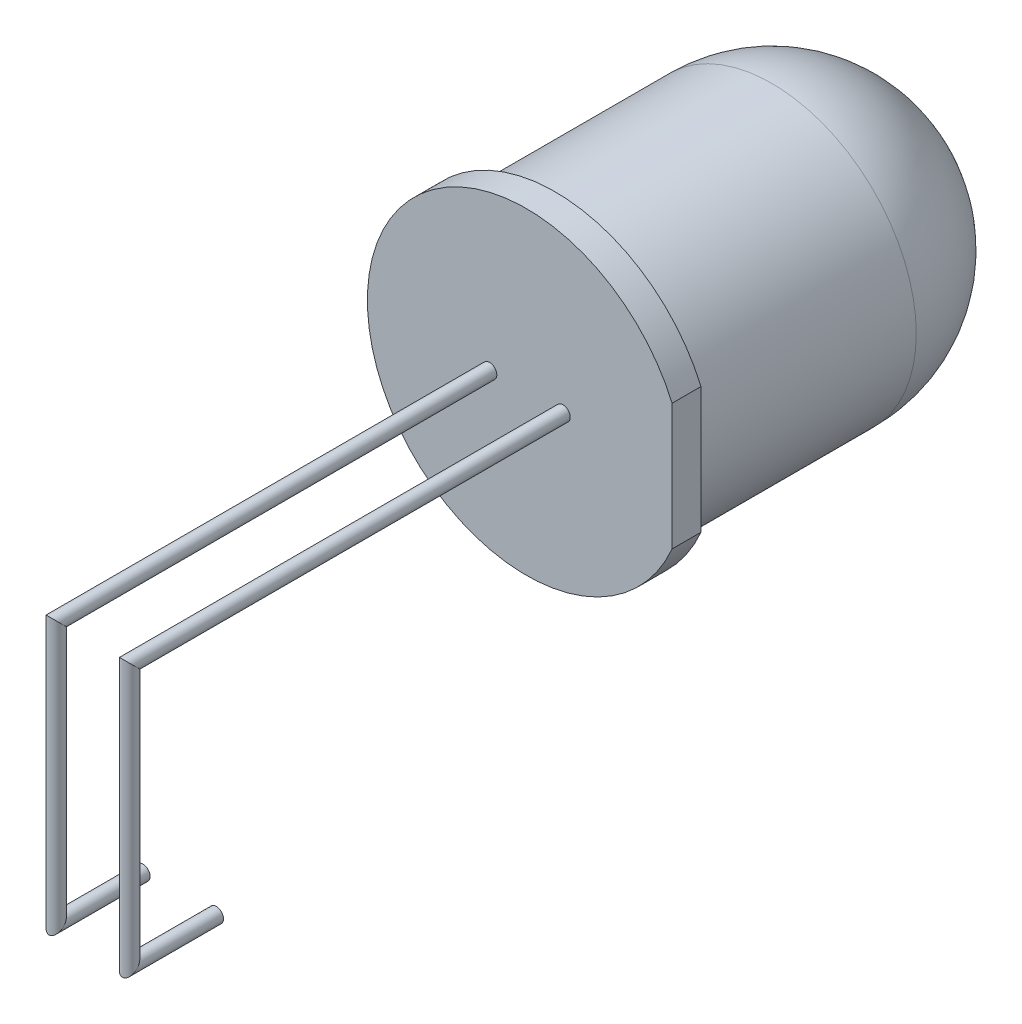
ISO-10303-21;
HEADER;
FILE_DESCRIPTION(('STEP AP214'),'2;1');
FILE_NAME('part.step','',(''),(''),'','','');
FILE_SCHEMA(('AUTOMOTIVE_DESIGN { 1 0 10303 214 1 1 1 1 }'));
ENDSEC;
DATA;
#1=APPLICATION_CONTEXT('core data for automotive mechanical design processes');
#2=APPLICATION_PROTOCOL_DEFINITION('international standard','automotive_design',2000,#1);
#3=PRODUCT_CONTEXT('',#1,'mechanical');
#4=PRODUCT('Part','Part','',(#3));
#5=PRODUCT_RELATED_PRODUCT_CATEGORY('part','',(#4));
#6=PRODUCT_DEFINITION_FORMATION('','',#4);
#7=PRODUCT_DEFINITION_CONTEXT('part definition',#1,'design');
#8=PRODUCT_DEFINITION('design','',#6,#7);
#9=PRODUCT_DEFINITION_SHAPE('','',#8);
#10=(LENGTH_UNIT() NAMED_UNIT(*) SI_UNIT(.MILLI.,.METRE.));
#11=(NAMED_UNIT(*) PLANE_ANGLE_UNIT() SI_UNIT($,.RADIAN.));
#12=(NAMED_UNIT(*) SI_UNIT($,.STERADIAN.) SOLID_ANGLE_UNIT());
#13=UNCERTAINTY_MEASURE_WITH_UNIT(LENGTH_MEASURE(1.E-05),#10,'distance_accuracy_value','');
#14=(GEOMETRIC_REPRESENTATION_CONTEXT(3) GLOBAL_UNCERTAINTY_ASSIGNED_CONTEXT((#13)) GLOBAL_UNIT_ASSIGNED_CONTEXT((#10,
#11,#12)) REPRESENTATION_CONTEXT('',''));
#15=CARTESIAN_POINT('',(0.,0.,0.));
#16=DIRECTION('',(0.,0.,1.));
#17=DIRECTION('',(1.,0.,0.));
#18=AXIS2_PLACEMENT_3D('',#15,#16,#17);
#19=CARTESIAN_POINT('',(0.,0.,13.5));
#20=DIRECTION('',(0.,0.,1.));
#21=DIRECTION('',(1.,0.,0.));
#22=AXIS2_PLACEMENT_3D('',#19,#20,#21);
#23=PLANE('',#22);
#24=CARTESIAN_POINT('',(1.27,0.,13.5));
#25=DIRECTION('',(0.,0.,1.));
#26=DIRECTION('',(1.,0.,0.));
#27=AXIS2_PLACEMENT_3D('',#24,#25,#26);
#28=CIRCLE('',#27,0.25);
#29=CARTESIAN_POINT('',(1.52,0.,13.5));
#30=VERTEX_POINT('',#29);
#31=EDGE_CURVE('E11',#30,#30,#28,.T.);
#32=ORIENTED_EDGE('',*,*,#31,.F.);
#33=EDGE_LOOP('',(#32));
#34=FACE_BOUND('',#33,.T.);
#35=CARTESIAN_POINT('',(0.,0.,13.5));
#36=DIRECTION('',(0.,0.,1.));
#37=DIRECTION('',(1.,0.,0.));
#38=AXIS2_PLACEMENT_3D('',#35,#36,#37);
#39=CIRCLE('',#38,5.5);
#40=CARTESIAN_POINT('',(5.04764087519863,2.1843355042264,13.5));
#41=VERTEX_POINT('',#40);
#42=CARTESIAN_POINT('',(5.04764087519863,-2.1843355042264,13.5));
#43=VERTEX_POINT('',#42);
#44=EDGE_CURVE('E52',#41,#43,#39,.T.);
#45=ORIENTED_EDGE('',*,*,#44,.T.);
#46=DIRECTION('',(0.,1.,0.));
#47=VECTOR('',#46,1.);
#48=CARTESIAN_POINT('',(5.04764087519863,2.1843355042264,13.5));
#49=LINE('',#48,#47);
#50=EDGE_CURVE('E47',#43,#41,#49,.T.);
#51=ORIENTED_EDGE('',*,*,#50,.T.);
#52=EDGE_LOOP('',(#45,#51));
#53=FACE_BOUND('',#52,.T.);
#54=CARTESIAN_POINT('',(-1.27,0.,13.5));
#55=DIRECTION('',(0.,0.,1.));
#56=DIRECTION('',(1.,0.,0.));
#57=AXIS2_PLACEMENT_3D('',#54,#55,#56);
#58=CIRCLE('',#57,0.25);
#59=CARTESIAN_POINT('',(-1.02,0.,13.5));
#60=VERTEX_POINT('',#59);
#61=EDGE_CURVE('E130',#60,#60,#58,.T.);
#62=ORIENTED_EDGE('',*,*,#61,.F.);
#63=EDGE_LOOP('',(#62));
#64=FACE_BOUND('',#63,.T.);
#65=ADVANCED_FACE('F17',(#34,#53,#64),#23,.T.);
#66=CARTESIAN_POINT('',(0.,0.,13.5));
#67=DIRECTION('',(0.,0.,-1.));
#68=DIRECTION('',(-1.,0.,0.));
#69=AXIS2_PLACEMENT_3D('',#66,#67,#68);
#70=CYLINDRICAL_SURFACE('',#69,5.);
#71=CARTESIAN_POINT('',(0.,0.,5.));
#72=DIRECTION('',(0.,0.,-1.));
#73=DIRECTION('',(-1.,0.,0.));
#74=AXIS2_PLACEMENT_3D('',#71,#72,#73);
#75=CIRCLE('',#74,5.);
#76=CARTESIAN_POINT('',(-5.,0.,5.));
#77=VERTEX_POINT('',#76);
#78=EDGE_CURVE('E26',#77,#77,#75,.F.);
#79=ORIENTED_EDGE('',*,*,#78,.T.);
#80=EDGE_LOOP('',(#79));
#81=FACE_BOUND('',#80,.T.);
#82=CARTESIAN_POINT('',(0.,0.,12.5));
#83=DIRECTION('',(0.,0.,1.));
#84=DIRECTION('',(1.,0.,0.));
#85=AXIS2_PLACEMENT_3D('',#82,#83,#84);
#86=CIRCLE('',#85,5.);
#87=CARTESIAN_POINT('',(5.,0.,12.5));
#88=VERTEX_POINT('',#87);
#89=EDGE_CURVE('E50',#88,#88,#86,.T.);
#90=ORIENTED_EDGE('',*,*,#89,.F.);
#91=EDGE_LOOP('',(#90));
#92=FACE_BOUND('',#91,.T.);
#93=ADVANCED_FACE('F68',(#81,#92),#70,.T.);
#94=CARTESIAN_POINT('',(0.,0.,12.5));
#95=DIRECTION('',(0.,0.,1.));
#96=DIRECTION('',(1.,0.,0.));
#97=AXIS2_PLACEMENT_3D('',#94,#95,#96);
#98=PLANE('',#97);
#99=CARTESIAN_POINT('',(0.,0.,12.5));
#100=DIRECTION('',(0.,0.,1.));
#101=DIRECTION('',(1.,0.,0.));
#102=AXIS2_PLACEMENT_3D('',#99,#100,#101);
#103=CIRCLE('',#102,5.5);
#104=CARTESIAN_POINT('',(5.04764087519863,2.1843355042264,12.5));
#105=VERTEX_POINT('',#104);
#106=CARTESIAN_POINT('',(5.04764087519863,-2.1843355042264,12.5));
#107=VERTEX_POINT('',#106);
#108=EDGE_CURVE('E58',#105,#107,#103,.T.);
#109=ORIENTED_EDGE('',*,*,#108,.F.);
#110=DIRECTION('',(0.,1.,0.));
#111=VECTOR('',#110,1.);
#112=CARTESIAN_POINT('',(5.04764087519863,2.1843355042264,12.5));
#113=LINE('',#112,#111);
#114=EDGE_CURVE('E49',#107,#105,#113,.T.);
#115=ORIENTED_EDGE('',*,*,#114,.F.);
#116=EDGE_LOOP('',(#109,#115));
#117=FACE_BOUND('',#116,.T.);
#118=ORIENTED_EDGE('',*,*,#89,.T.);
#119=EDGE_LOOP('',(#118));
#120=FACE_BOUND('',#119,.T.);
#121=ADVANCED_FACE('F88',(#117,#120),#98,.F.);
#122=CARTESIAN_POINT('',(0.,0.,12.5));
#123=DIRECTION('',(0.,0.,1.));
#124=DIRECTION('',(1.,0.,0.));
#125=AXIS2_PLACEMENT_3D('',#122,#123,#124);
#126=CYLINDRICAL_SURFACE('',#125,5.5);
#127=ORIENTED_EDGE('',*,*,#44,.F.);
#128=DIRECTION('',(0.,0.,1.));
#129=VECTOR('',#128,1.);
#130=CARTESIAN_POINT('',(5.04764087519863,2.1843355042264,12.5));
#131=LINE('',#130,#129);
#132=EDGE_CURVE('E34',#105,#41,#131,.T.);
#133=ORIENTED_EDGE('',*,*,#132,.F.);
#134=ORIENTED_EDGE('',*,*,#108,.T.);
#135=DIRECTION('',(0.,0.,1.));
#136=VECTOR('',#135,1.);
#137=CARTESIAN_POINT('',(5.04764087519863,-2.1843355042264,12.5));
#138=LINE('',#137,#136);
#139=EDGE_CURVE('E40',#107,#43,#138,.T.);
#140=ORIENTED_EDGE('',*,*,#139,.T.);
#141=EDGE_LOOP('',(#127,#133,#134,#140));
#142=FACE_BOUND('',#141,.T.);
#143=ADVANCED_FACE('F53',(#142),#126,.T.);
#144=CARTESIAN_POINT('',(5.04764087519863,2.1843355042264,12.5));
#145=DIRECTION('',(1.,0.,0.));
#146=DIRECTION('',(0.,0.,-1.));
#147=AXIS2_PLACEMENT_3D('',#144,#145,#146);
#148=PLANE('',#147);
#149=ORIENTED_EDGE('',*,*,#50,.F.);
#150=ORIENTED_EDGE('',*,*,#139,.F.);
#151=ORIENTED_EDGE('',*,*,#114,.T.);
#152=ORIENTED_EDGE('',*,*,#132,.T.);
#153=EDGE_LOOP('',(#149,#150,#151,#152));
#154=FACE_BOUND('',#153,.T.);
#155=ADVANCED_FACE('F45',(#154),#148,.T.);
#156=CARTESIAN_POINT('',(0.,0.,5.));
#157=DIRECTION('',(0.,0.,1.));
#158=DIRECTION('',(1.,0.,0.));
#159=AXIS2_PLACEMENT_3D('',#156,#157,#158);
#160=SPHERICAL_SURFACE('',#159,5.);
#161=ORIENTED_EDGE('',*,*,#78,.F.);
#162=EDGE_LOOP('',(#161));
#163=FACE_BOUND('',#162,.T.);
#164=ADVANCED_FACE('F19',(#163),#160,.T.);
#165=CARTESIAN_POINT('',(-1.27,-9.04,28.5));
#166=DIRECTION('',(0.,0.,-1.));
#167=DIRECTION('',(-1.,0.,0.));
#168=AXIS2_PLACEMENT_3D('',#165,#166,#167);
#169=CYLINDRICAL_SURFACE('',#168,0.25);
#170=CARTESIAN_POINT('',(-1.27,-9.04,28.5));
#171=DIRECTION('',(0.,-0.707106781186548,-0.707106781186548));
#172=DIRECTION('',(0.,-0.707106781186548,0.707106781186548));
#173=AXIS2_PLACEMENT_3D('',#170,#171,#172);
#174=ELLIPSE('',#173,0.353553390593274,0.25);
#175=CARTESIAN_POINT('',(-1.27,-9.29,28.75));
#176=VERTEX_POINT('',#175);
#177=EDGE_CURVE('E143',#176,#176,#174,.F.);
#178=ORIENTED_EDGE('',*,*,#177,.F.);
#179=EDGE_LOOP('',(#178));
#180=FACE_BOUND('',#179,.T.);
#181=CARTESIAN_POINT('',(-1.27,-9.04,25.5));
#182=DIRECTION('',(0.,0.,-1.));
#183=DIRECTION('',(-1.,0.,0.));
#184=AXIS2_PLACEMENT_3D('',#181,#182,#183);
#185=CIRCLE('',#184,0.25);
#186=CARTESIAN_POINT('',(-1.52,-9.04,25.5));
#187=VERTEX_POINT('',#186);
#188=EDGE_CURVE('E55',#187,#187,#185,.T.);
#189=ORIENTED_EDGE('',*,*,#188,.F.);
#190=EDGE_LOOP('',(#189));
#191=FACE_BOUND('',#190,.T.);
#192=ADVANCED_FACE('F72',(#180,#191),#169,.T.);
#193=CARTESIAN_POINT('',(-1.27,0.,28.5));
#194=DIRECTION('',(0.,-1.,0.));
#195=DIRECTION('',(0.,0.,-1.));
#196=AXIS2_PLACEMENT_3D('',#193,#194,#195);
#197=CYLINDRICAL_SURFACE('',#196,0.25);
#198=CARTESIAN_POINT('',(-1.27,0.,28.5));
#199=DIRECTION('',(0.,-0.707106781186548,0.707106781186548));
#200=DIRECTION('',(0.,-0.707106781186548,-0.707106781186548));
#201=AXIS2_PLACEMENT_3D('',#198,#199,#200);
#202=ELLIPSE('',#201,0.353553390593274,0.25);
#203=CARTESIAN_POINT('',(-1.27,-0.25,28.25));
#204=VERTEX_POINT('',#203);
#205=EDGE_CURVE('E134',#204,#204,#202,.T.);
#206=ORIENTED_EDGE('',*,*,#205,.T.);
#207=EDGE_LOOP('',(#206));
#208=FACE_BOUND('',#207,.T.);
#209=ORIENTED_EDGE('',*,*,#177,.T.);
#210=EDGE_LOOP('',(#209));
#211=FACE_BOUND('',#210,.T.);
#212=ADVANCED_FACE('F78',(#208,#211),#197,.T.);
#213=CARTESIAN_POINT('',(-1.27,0.,29.2071067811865));
#214=DIRECTION('',(0.,0.,-1.));
#215=DIRECTION('',(-1.,0.,0.));
#216=AXIS2_PLACEMENT_3D('',#213,#214,#215);
#217=CYLINDRICAL_SURFACE('',#216,0.25);
#218=ORIENTED_EDGE('',*,*,#61,.T.);
#219=EDGE_LOOP('',(#218));
#220=FACE_BOUND('',#219,.T.);
#221=ORIENTED_EDGE('',*,*,#205,.F.);
#222=EDGE_LOOP('',(#221));
#223=FACE_BOUND('',#222,.T.);
#224=ADVANCED_FACE('F98',(#220,#223),#217,.T.);
#225=CARTESIAN_POINT('',(-1.27,-9.04,25.5));
#226=DIRECTION('',(0.,0.,-1.));
#227=DIRECTION('',(-1.,0.,0.));
#228=AXIS2_PLACEMENT_3D('',#225,#226,#227);
#229=PLANE('',#228);
#230=ORIENTED_EDGE('',*,*,#188,.T.);
#231=EDGE_LOOP('',(#230));
#232=FACE_BOUND('',#231,.T.);
#233=ADVANCED_FACE('F102',(#232),#229,.T.);
#234=CARTESIAN_POINT('',(1.27,-9.04,28.5));
#235=DIRECTION('',(0.,0.,-1.));
#236=DIRECTION('',(-1.,0.,0.));
#237=AXIS2_PLACEMENT_3D('',#234,#235,#236);
#238=CYLINDRICAL_SURFACE('',#237,0.25);
#239=CARTESIAN_POINT('',(1.27,-9.04,28.5));
#240=DIRECTION('',(0.,-0.707106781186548,-0.707106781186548));
#241=DIRECTION('',(0.,-0.707106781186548,0.707106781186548));
#242=AXIS2_PLACEMENT_3D('',#239,#240,#241);
#243=ELLIPSE('',#242,0.353553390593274,0.25);
#244=CARTESIAN_POINT('',(1.27,-9.29,28.75));
#245=VERTEX_POINT('',#244);
#246=EDGE_CURVE('E131',#245,#245,#243,.T.);
#247=ORIENTED_EDGE('',*,*,#246,.T.);
#248=EDGE_LOOP('',(#247));
#249=FACE_BOUND('',#248,.T.);
#250=CARTESIAN_POINT('',(1.27,-9.04,25.5));
#251=DIRECTION('',(0.,0.,-1.));
#252=DIRECTION('',(-1.,0.,0.));
#253=AXIS2_PLACEMENT_3D('',#250,#251,#252);
#254=CIRCLE('',#253,0.25);
#255=CARTESIAN_POINT('',(1.02,-9.04,25.5));
#256=VERTEX_POINT('',#255);
#257=EDGE_CURVE('E128',#256,#256,#254,.F.);
#258=ORIENTED_EDGE('',*,*,#257,.T.);
#259=EDGE_LOOP('',(#258));
#260=FACE_BOUND('',#259,.T.);
#261=ADVANCED_FACE('F106',(#249,#260),#238,.T.);
#262=CARTESIAN_POINT('',(1.27,0.,28.5));
#263=DIRECTION('',(0.,-1.,0.));
#264=DIRECTION('',(0.,0.,-1.));
#265=AXIS2_PLACEMENT_3D('',#262,#263,#264);
#266=CYLINDRICAL_SURFACE('',#265,0.25);
#267=CARTESIAN_POINT('',(1.27,0.,28.5));
#268=DIRECTION('',(0.,-0.707106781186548,0.707106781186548));
#269=DIRECTION('',(0.,-0.707106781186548,-0.707106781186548));
#270=AXIS2_PLACEMENT_3D('',#267,#268,#269);
#271=ELLIPSE('',#270,0.353553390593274,0.25);
#272=CARTESIAN_POINT('',(1.27,-0.25,28.25));
#273=VERTEX_POINT('',#272);
#274=EDGE_CURVE('E137',#273,#273,#271,.F.);
#275=ORIENTED_EDGE('',*,*,#274,.F.);
#276=EDGE_LOOP('',(#275));
#277=FACE_BOUND('',#276,.T.);
#278=ORIENTED_EDGE('',*,*,#246,.F.);
#279=EDGE_LOOP('',(#278));
#280=FACE_BOUND('',#279,.T.);
#281=ADVANCED_FACE('F110',(#277,#280),#266,.T.);
#282=CARTESIAN_POINT('',(1.27,0.,29.2071067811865));
#283=DIRECTION('',(0.,0.,-1.));
#284=DIRECTION('',(-1.,0.,0.));
#285=AXIS2_PLACEMENT_3D('',#282,#283,#284);
#286=CYLINDRICAL_SURFACE('',#285,0.25);
#287=ORIENTED_EDGE('',*,*,#31,.T.);
#288=EDGE_LOOP('',(#287));
#289=FACE_BOUND('',#288,.T.);
#290=ORIENTED_EDGE('',*,*,#274,.T.);
#291=EDGE_LOOP('',(#290));
#292=FACE_BOUND('',#291,.T.);
#293=ADVANCED_FACE('F114',(#289,#292),#286,.T.);
#294=CARTESIAN_POINT('',(1.27,-9.04,25.5));
#295=DIRECTION('',(0.,0.,-1.));
#296=DIRECTION('',(-1.,0.,0.));
#297=AXIS2_PLACEMENT_3D('',#294,#295,#296);
#298=PLANE('',#297);
#299=ORIENTED_EDGE('',*,*,#257,.F.);
#300=EDGE_LOOP('',(#299));
#301=FACE_BOUND('',#300,.T.);
#302=ADVANCED_FACE('F118',(#301),#298,.T.);
#303=CLOSED_SHELL('',(#65,#93,#121,#143,#155,#164,#192,#212,#224,#233,#261,#281,#293,#302));
#304=MANIFOLD_SOLID_BREP('B1',#303);
#305=ADVANCED_BREP_SHAPE_REPRESENTATION('',(#18,#304),#14);
#306=SHAPE_DEFINITION_REPRESENTATION(#9,#305);
ENDSEC;
END-ISO-10303-21;
